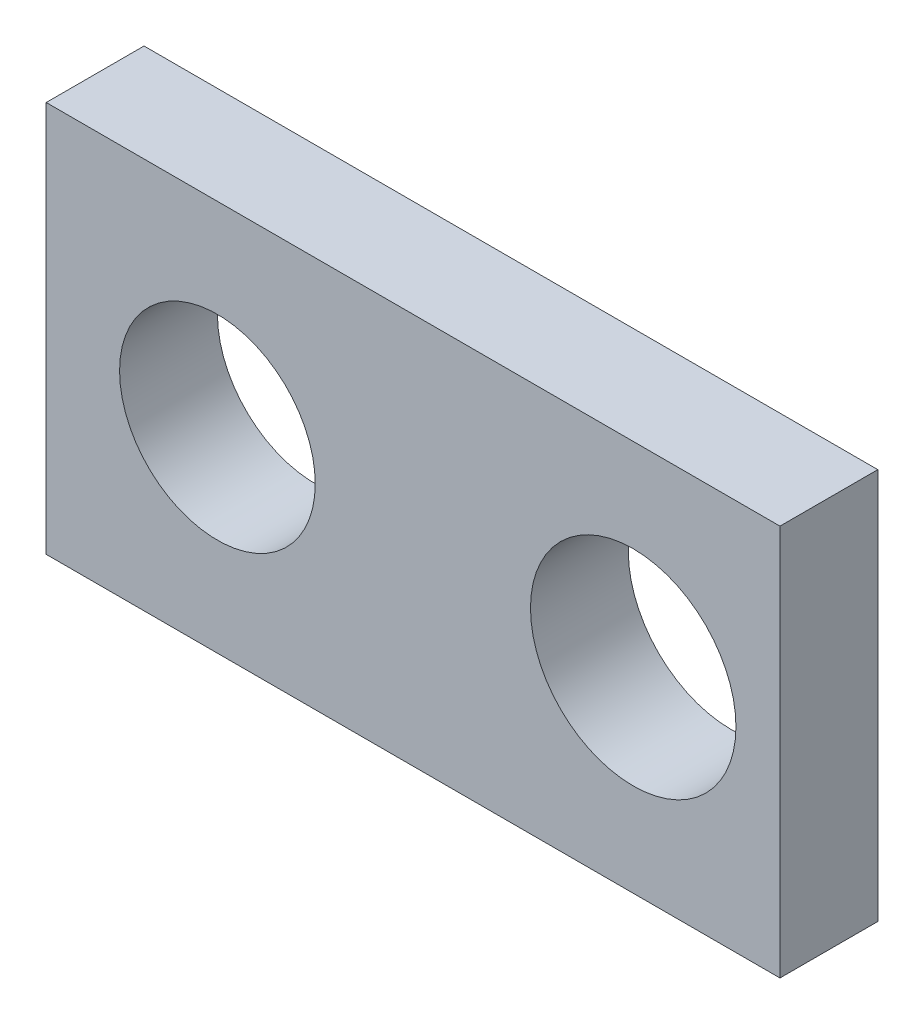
ISO-10303-21;
HEADER;
FILE_DESCRIPTION(('STEP AP214'),'2;1');
FILE_NAME('part.step','',(''),(''),'','','');
FILE_SCHEMA(('AUTOMOTIVE_DESIGN { 1 0 10303 214 1 1 1 1 }'));
ENDSEC;
DATA;
#1=APPLICATION_CONTEXT('core data for automotive mechanical design processes');
#2=APPLICATION_PROTOCOL_DEFINITION('international standard','automotive_design',2000,#1);
#3=PRODUCT_CONTEXT('',#1,'mechanical');
#4=PRODUCT('Part','Part','',(#3));
#5=PRODUCT_RELATED_PRODUCT_CATEGORY('part','',(#4));
#6=PRODUCT_DEFINITION_FORMATION('','',#4);
#7=PRODUCT_DEFINITION_CONTEXT('part definition',#1,'design');
#8=PRODUCT_DEFINITION('design','',#6,#7);
#9=PRODUCT_DEFINITION_SHAPE('','',#8);
#10=(LENGTH_UNIT() NAMED_UNIT(*) SI_UNIT(.MILLI.,.METRE.));
#11=(NAMED_UNIT(*) PLANE_ANGLE_UNIT() SI_UNIT($,.RADIAN.));
#12=(NAMED_UNIT(*) SI_UNIT($,.STERADIAN.) SOLID_ANGLE_UNIT());
#13=UNCERTAINTY_MEASURE_WITH_UNIT(LENGTH_MEASURE(1.E-05),#10,'distance_accuracy_value','');
#14=(GEOMETRIC_REPRESENTATION_CONTEXT(3) GLOBAL_UNCERTAINTY_ASSIGNED_CONTEXT((#13)) GLOBAL_UNIT_ASSIGNED_CONTEXT((#10,
#11,#12)) REPRESENTATION_CONTEXT('',''));
#15=CARTESIAN_POINT('',(0.,0.,0.));
#16=DIRECTION('',(0.,0.,1.));
#17=DIRECTION('',(1.,0.,0.));
#18=AXIS2_PLACEMENT_3D('',#15,#16,#17);
#19=CARTESIAN_POINT('',(0.,0.,20.));
#20=DIRECTION('',(1.,0.,0.));
#21=DIRECTION('',(0.,0.,-1.));
#22=AXIS2_PLACEMENT_3D('',#19,#20,#21);
#23=PLANE('',#22);
#24=DIRECTION('',(0.,-1.,0.));
#25=VECTOR('',#24,1.);
#26=CARTESIAN_POINT('',(0.,0.,0.));
#27=LINE('',#26,#25);
#28=CARTESIAN_POINT('',(0.,80.,0.));
#29=VERTEX_POINT('',#28);
#30=CARTESIAN_POINT('',(0.,0.,0.));
#31=VERTEX_POINT('',#30);
#32=EDGE_CURVE('E68',#29,#31,#27,.T.);
#33=ORIENTED_EDGE('',*,*,#32,.T.);
#34=DIRECTION('',(0.,0.,-1.));
#35=VECTOR('',#34,1.);
#36=CARTESIAN_POINT('',(0.,0.,20.));
#37=LINE('',#36,#35);
#38=CARTESIAN_POINT('',(0.,0.,20.));
#39=VERTEX_POINT('',#38);
#40=EDGE_CURVE('E11',#39,#31,#37,.T.);
#41=ORIENTED_EDGE('',*,*,#40,.F.);
#42=DIRECTION('',(0.,-1.,0.));
#43=VECTOR('',#42,1.);
#44=CARTESIAN_POINT('',(0.,0.,20.));
#45=LINE('',#44,#43);
#46=CARTESIAN_POINT('',(0.,80.,20.));
#47=VERTEX_POINT('',#46);
#48=EDGE_CURVE('E91',#47,#39,#45,.T.);
#49=ORIENTED_EDGE('',*,*,#48,.F.);
#50=DIRECTION('',(0.,0.,-1.));
#51=VECTOR('',#50,1.);
#52=CARTESIAN_POINT('',(0.,80.,20.));
#53=LINE('',#52,#51);
#54=EDGE_CURVE('E80',#47,#29,#53,.T.);
#55=ORIENTED_EDGE('',*,*,#54,.T.);
#56=EDGE_LOOP('',(#33,#41,#49,#55));
#57=FACE_BOUND('',#56,.T.);
#58=ADVANCED_FACE('F24',(#57),#23,.F.);
#59=CARTESIAN_POINT('',(0.,0.,20.));
#60=DIRECTION('',(0.,1.,0.));
#61=DIRECTION('',(0.,0.,1.));
#62=AXIS2_PLACEMENT_3D('',#59,#60,#61);
#63=PLANE('',#62);
#64=DIRECTION('',(1.,0.,0.));
#65=VECTOR('',#64,1.);
#66=CARTESIAN_POINT('',(0.,0.,0.));
#67=LINE('',#66,#65);
#68=CARTESIAN_POINT('',(150.,0.,0.));
#69=VERTEX_POINT('',#68);
#70=EDGE_CURVE('E64',#31,#69,#67,.T.);
#71=ORIENTED_EDGE('',*,*,#70,.T.);
#72=DIRECTION('',(0.,0.,-1.));
#73=VECTOR('',#72,1.);
#74=CARTESIAN_POINT('',(150.,0.,20.));
#75=LINE('',#74,#73);
#76=CARTESIAN_POINT('',(150.,0.,20.));
#77=VERTEX_POINT('',#76);
#78=EDGE_CURVE('E31',#77,#69,#75,.T.);
#79=ORIENTED_EDGE('',*,*,#78,.F.);
#80=DIRECTION('',(1.,0.,0.));
#81=VECTOR('',#80,1.);
#82=CARTESIAN_POINT('',(0.,0.,20.));
#83=LINE('',#82,#81);
#84=EDGE_CURVE('E76',#39,#77,#83,.T.);
#85=ORIENTED_EDGE('',*,*,#84,.F.);
#86=ORIENTED_EDGE('',*,*,#40,.T.);
#87=EDGE_LOOP('',(#71,#79,#85,#86));
#88=FACE_BOUND('',#87,.T.);
#89=ADVANCED_FACE('F75',(#88),#63,.F.);
#90=CARTESIAN_POINT('',(150.,0.,20.));
#91=DIRECTION('',(-1.,0.,0.));
#92=DIRECTION('',(0.,-1.,0.));
#93=AXIS2_PLACEMENT_3D('',#90,#91,#92);
#94=PLANE('',#93);
#95=DIRECTION('',(0.,1.,0.));
#96=VECTOR('',#95,1.);
#97=CARTESIAN_POINT('',(150.,0.,0.));
#98=LINE('',#97,#96);
#99=CARTESIAN_POINT('',(150.,80.,0.));
#100=VERTEX_POINT('',#99);
#101=EDGE_CURVE('E69',#69,#100,#98,.T.);
#102=ORIENTED_EDGE('',*,*,#101,.T.);
#103=DIRECTION('',(0.,0.,-1.));
#104=VECTOR('',#103,1.);
#105=CARTESIAN_POINT('',(150.,80.,20.));
#106=LINE('',#105,#104);
#107=CARTESIAN_POINT('',(150.,80.,20.));
#108=VERTEX_POINT('',#107);
#109=EDGE_CURVE('E97',#108,#100,#106,.T.);
#110=ORIENTED_EDGE('',*,*,#109,.F.);
#111=DIRECTION('',(0.,1.,0.));
#112=VECTOR('',#111,1.);
#113=CARTESIAN_POINT('',(150.,0.,20.));
#114=LINE('',#113,#112);
#115=EDGE_CURVE('E43',#77,#108,#114,.T.);
#116=ORIENTED_EDGE('',*,*,#115,.F.);
#117=ORIENTED_EDGE('',*,*,#78,.T.);
#118=EDGE_LOOP('',(#102,#110,#116,#117));
#119=FACE_BOUND('',#118,.T.);
#120=ADVANCED_FACE('F100',(#119),#94,.F.);
#121=CARTESIAN_POINT('',(0.,80.,20.));
#122=DIRECTION('',(0.,-1.,0.));
#123=DIRECTION('',(0.,0.,-1.));
#124=AXIS2_PLACEMENT_3D('',#121,#122,#123);
#125=PLANE('',#124);
#126=DIRECTION('',(-1.,0.,0.));
#127=VECTOR('',#126,1.);
#128=CARTESIAN_POINT('',(0.,80.,0.));
#129=LINE('',#128,#127);
#130=EDGE_CURVE('E89',#100,#29,#129,.T.);
#131=ORIENTED_EDGE('',*,*,#130,.T.);
#132=ORIENTED_EDGE('',*,*,#54,.F.);
#133=DIRECTION('',(-1.,0.,0.));
#134=VECTOR('',#133,1.);
#135=CARTESIAN_POINT('',(0.,80.,20.));
#136=LINE('',#135,#134);
#137=EDGE_CURVE('E38',#108,#47,#136,.T.);
#138=ORIENTED_EDGE('',*,*,#137,.F.);
#139=ORIENTED_EDGE('',*,*,#109,.T.);
#140=EDGE_LOOP('',(#131,#132,#138,#139));
#141=FACE_BOUND('',#140,.T.);
#142=ADVANCED_FACE('F102',(#141),#125,.F.);
#143=CARTESIAN_POINT('',(0.,80.,20.));
#144=DIRECTION('',(0.,0.,-1.));
#145=DIRECTION('',(-1.,0.,0.));
#146=AXIS2_PLACEMENT_3D('',#143,#144,#145);
#147=PLANE('',#146);
#148=CARTESIAN_POINT('',(35.,40.,20.));
#149=DIRECTION('',(0.,0.,1.));
#150=DIRECTION('',(1.,0.,0.));
#151=AXIS2_PLACEMENT_3D('',#148,#149,#150);
#152=CIRCLE('',#151,20.);
#153=CARTESIAN_POINT('',(55.,40.,20.));
#154=VERTEX_POINT('',#153);
#155=EDGE_CURVE('E159',#154,#154,#152,.T.);
#156=ORIENTED_EDGE('',*,*,#155,.F.);
#157=EDGE_LOOP('',(#156));
#158=FACE_BOUND('',#157,.T.);
#159=CARTESIAN_POINT('',(120.,40.,20.));
#160=DIRECTION('',(0.,0.,1.));
#161=DIRECTION('',(1.,0.,0.));
#162=AXIS2_PLACEMENT_3D('',#159,#160,#161);
#163=CIRCLE('',#162,21.);
#164=CARTESIAN_POINT('',(141.,40.,20.));
#165=VERTEX_POINT('',#164);
#166=EDGE_CURVE('E84',#165,#165,#163,.T.);
#167=ORIENTED_EDGE('',*,*,#166,.F.);
#168=EDGE_LOOP('',(#167));
#169=FACE_BOUND('',#168,.T.);
#170=ORIENTED_EDGE('',*,*,#48,.T.);
#171=ORIENTED_EDGE('',*,*,#84,.T.);
#172=ORIENTED_EDGE('',*,*,#115,.T.);
#173=ORIENTED_EDGE('',*,*,#137,.T.);
#174=EDGE_LOOP('',(#170,#171,#172,#173));
#175=FACE_BOUND('',#174,.T.);
#176=ADVANCED_FACE('F103',(#158,#169,#175),#147,.F.);
#177=CARTESIAN_POINT('',(0.,80.,0.));
#178=DIRECTION('',(0.,0.,-1.));
#179=DIRECTION('',(-1.,0.,0.));
#180=AXIS2_PLACEMENT_3D('',#177,#178,#179);
#181=PLANE('',#180);
#182=CARTESIAN_POINT('',(35.,40.,0.));
#183=DIRECTION('',(0.,0.,1.));
#184=DIRECTION('',(1.,0.,0.));
#185=AXIS2_PLACEMENT_3D('',#182,#183,#184);
#186=CIRCLE('',#185,20.);
#187=CARTESIAN_POINT('',(55.,40.,0.));
#188=VERTEX_POINT('',#187);
#189=EDGE_CURVE('E157',#188,#188,#186,.T.);
#190=ORIENTED_EDGE('',*,*,#189,.T.);
#191=EDGE_LOOP('',(#190));
#192=FACE_BOUND('',#191,.T.);
#193=CARTESIAN_POINT('',(120.,40.,0.));
#194=DIRECTION('',(0.,0.,1.));
#195=DIRECTION('',(1.,0.,0.));
#196=AXIS2_PLACEMENT_3D('',#193,#194,#195);
#197=CIRCLE('',#196,21.);
#198=CARTESIAN_POINT('',(141.,40.,0.));
#199=VERTEX_POINT('',#198);
#200=EDGE_CURVE('E81',#199,#199,#197,.T.);
#201=ORIENTED_EDGE('',*,*,#200,.T.);
#202=EDGE_LOOP('',(#201));
#203=FACE_BOUND('',#202,.T.);
#204=ORIENTED_EDGE('',*,*,#32,.F.);
#205=ORIENTED_EDGE('',*,*,#130,.F.);
#206=ORIENTED_EDGE('',*,*,#101,.F.);
#207=ORIENTED_EDGE('',*,*,#70,.F.);
#208=EDGE_LOOP('',(#204,#205,#206,#207));
#209=FACE_BOUND('',#208,.T.);
#210=ADVANCED_FACE('F65',(#192,#203,#209),#181,.T.);
#211=CARTESIAN_POINT('',(120.,40.,0.));
#212=DIRECTION('',(0.,0.,1.));
#213=DIRECTION('',(1.,0.,0.));
#214=AXIS2_PLACEMENT_3D('',#211,#212,#213);
#215=CYLINDRICAL_SURFACE('',#214,21.);
#216=ORIENTED_EDGE('',*,*,#200,.F.);
#217=EDGE_LOOP('',(#216));
#218=FACE_BOUND('',#217,.T.);
#219=ORIENTED_EDGE('',*,*,#166,.T.);
#220=EDGE_LOOP('',(#219));
#221=FACE_BOUND('',#220,.T.);
#222=ADVANCED_FACE('F111',(#218,#221),#215,.F.);
#223=CARTESIAN_POINT('',(35.,40.,0.));
#224=DIRECTION('',(0.,0.,1.));
#225=DIRECTION('',(1.,0.,0.));
#226=AXIS2_PLACEMENT_3D('',#223,#224,#225);
#227=CYLINDRICAL_SURFACE('',#226,20.);
#228=ORIENTED_EDGE('',*,*,#189,.F.);
#229=EDGE_LOOP('',(#228));
#230=FACE_BOUND('',#229,.T.);
#231=ORIENTED_EDGE('',*,*,#155,.T.);
#232=EDGE_LOOP('',(#231));
#233=FACE_BOUND('',#232,.T.);
#234=ADVANCED_FACE('F144',(#230,#233),#227,.F.);
#235=CLOSED_SHELL('',(#58,#89,#120,#142,#176,#210,#222,#234));
#236=MANIFOLD_SOLID_BREP('B2',#235);
#237=ADVANCED_BREP_SHAPE_REPRESENTATION('',(#18,#236),#14);
#238=SHAPE_DEFINITION_REPRESENTATION(#9,#237);
ENDSEC;
END-ISO-10303-21;
